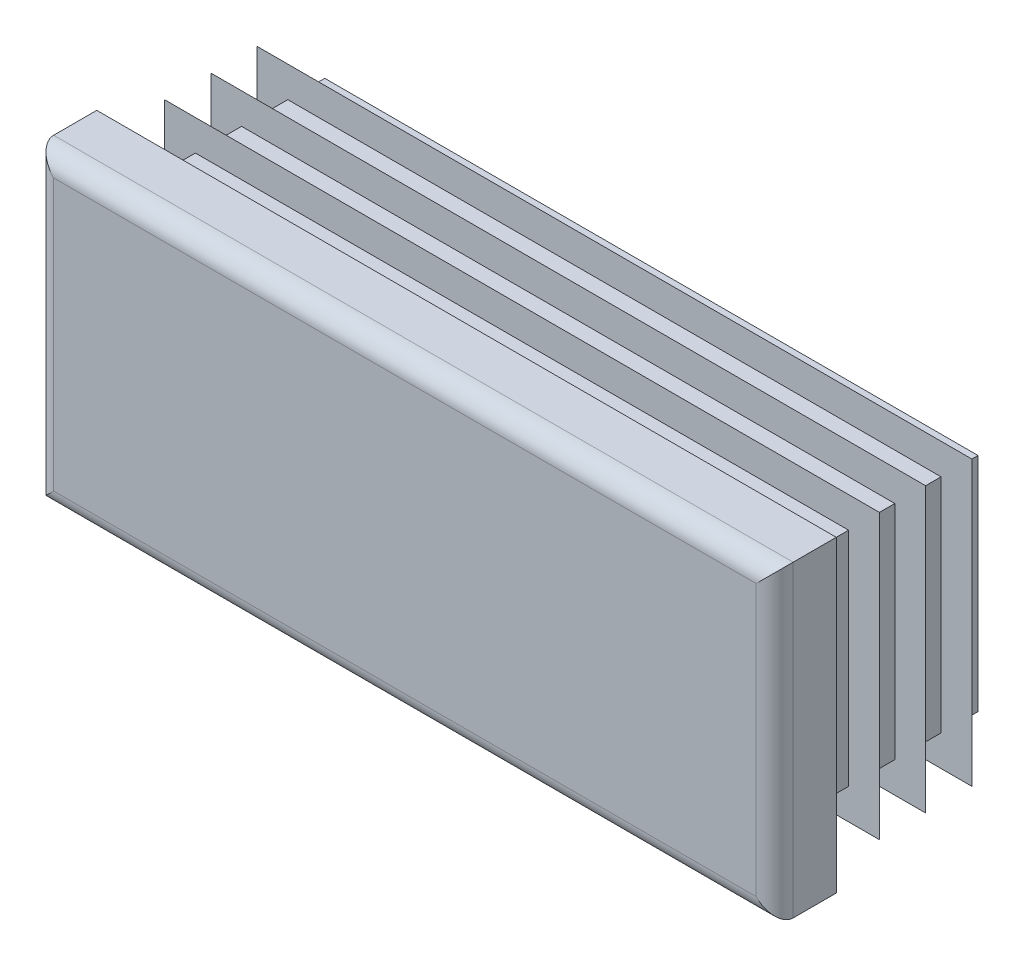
ISO-10303-21;
HEADER;
FILE_DESCRIPTION(('STEP AP214'),'2;1');
FILE_NAME('part.step','',(''),(''),'','','');
FILE_SCHEMA(('AUTOMOTIVE_DESIGN { 1 0 10303 214 1 1 1 1 }'));
ENDSEC;
DATA;
#1=APPLICATION_CONTEXT('core data for automotive mechanical design processes');
#2=APPLICATION_PROTOCOL_DEFINITION('international standard','automotive_design',2000,#1);
#3=PRODUCT_CONTEXT('',#1,'mechanical');
#4=PRODUCT('Part','Part','',(#3));
#5=PRODUCT_RELATED_PRODUCT_CATEGORY('part','',(#4));
#6=PRODUCT_DEFINITION_FORMATION('','',#4);
#7=PRODUCT_DEFINITION_CONTEXT('part definition',#1,'design');
#8=PRODUCT_DEFINITION('design','',#6,#7);
#9=PRODUCT_DEFINITION_SHAPE('','',#8);
#10=(LENGTH_UNIT() NAMED_UNIT(*) SI_UNIT(.MILLI.,.METRE.));
#11=(NAMED_UNIT(*) PLANE_ANGLE_UNIT() SI_UNIT($,.RADIAN.));
#12=(NAMED_UNIT(*) SI_UNIT($,.STERADIAN.) SOLID_ANGLE_UNIT());
#13=UNCERTAINTY_MEASURE_WITH_UNIT(LENGTH_MEASURE(1.E-05),#10,'distance_accuracy_value','');
#14=(GEOMETRIC_REPRESENTATION_CONTEXT(3) GLOBAL_UNCERTAINTY_ASSIGNED_CONTEXT((#13)) GLOBAL_UNIT_ASSIGNED_CONTEXT((#10,
#11,#12)) REPRESENTATION_CONTEXT('',''));
#15=CARTESIAN_POINT('',(0.,0.,0.));
#16=DIRECTION('',(0.,0.,1.));
#17=DIRECTION('',(1.,0.,0.));
#18=AXIS2_PLACEMENT_3D('',#15,#16,#17);
#19=CARTESIAN_POINT('',(28.5,-12.5,5.));
#20=DIRECTION('',(0.,0.,-1.));
#21=DIRECTION('',(0.,1.,0.));
#22=AXIS2_PLACEMENT_3D('',#19,#20,#21);
#23=PLANE('',#22);
#24=DIRECTION('',(0.,1.,0.));
#25=VECTOR('',#24,1.);
#26=CARTESIAN_POINT('',(-28.5,-12.5,5.));
#27=LINE('',#26,#25);
#28=CARTESIAN_POINT('',(-28.5,-11.,5.));
#29=VERTEX_POINT('',#28);
#30=CARTESIAN_POINT('',(-28.5,11.,5.));
#31=VERTEX_POINT('',#30);
#32=EDGE_CURVE('E310',#29,#31,#27,.T.);
#33=ORIENTED_EDGE('',*,*,#32,.F.);
#34=DIRECTION('',(-1.,0.,0.));
#35=VECTOR('',#34,1.);
#36=CARTESIAN_POINT('',(30.,-11.,5.));
#37=LINE('',#36,#35);
#38=CARTESIAN_POINT('',(28.5,-11.,5.));
#39=VERTEX_POINT('',#38);
#40=EDGE_CURVE('E482',#39,#29,#37,.T.);
#41=ORIENTED_EDGE('',*,*,#40,.F.);
#42=DIRECTION('',(0.,1.,0.));
#43=VECTOR('',#42,1.);
#44=CARTESIAN_POINT('',(28.5,-12.5,5.));
#45=LINE('',#44,#43);
#46=CARTESIAN_POINT('',(28.5,11.,5.));
#47=VERTEX_POINT('',#46);
#48=EDGE_CURVE('E305',#39,#47,#45,.T.);
#49=ORIENTED_EDGE('',*,*,#48,.T.);
#50=DIRECTION('',(-1.,0.,0.));
#51=VECTOR('',#50,1.);
#52=CARTESIAN_POINT('',(30.,11.,5.));
#53=LINE('',#52,#51);
#54=EDGE_CURVE('E630',#47,#31,#53,.T.);
#55=ORIENTED_EDGE('',*,*,#54,.T.);
#56=EDGE_LOOP('',(#33,#41,#49,#55));
#57=FACE_BOUND('',#56,.T.);
#58=ADVANCED_FACE('F14',(#57),#23,.F.);
#59=CARTESIAN_POINT('',(-28.5,-12.5,3.5));
#60=DIRECTION('',(0.,1.,0.));
#61=DIRECTION('',(-1.,0.,0.));
#62=AXIS2_PLACEMENT_3D('',#59,#60,#61);
#63=CYLINDRICAL_SURFACE('',#62,1.5);
#64=DIRECTION('',(0.,1.,0.));
#65=VECTOR('',#64,1.);
#66=CARTESIAN_POINT('',(-30.,-12.5,3.5));
#67=LINE('',#66,#65);
#68=CARTESIAN_POINT('',(-30.,-12.5,3.5));
#69=VERTEX_POINT('',#68);
#70=CARTESIAN_POINT('',(-30.,12.5,3.5));
#71=VERTEX_POINT('',#70);
#72=EDGE_CURVE('E402',#69,#71,#67,.T.);
#73=ORIENTED_EDGE('',*,*,#72,.F.);
#74=CARTESIAN_POINT('',(-28.5,-11.,3.5));
#75=DIRECTION('',(-0.707106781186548,0.707106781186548,0.));
#76=DIRECTION('',(0.707106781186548,0.707106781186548,0.));
#77=AXIS2_PLACEMENT_3D('',#74,#75,#76);
#78=ELLIPSE('',#77,2.12132034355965,1.5);
#79=EDGE_CURVE('E59',#69,#29,#78,.T.);
#80=ORIENTED_EDGE('',*,*,#79,.T.);
#81=ORIENTED_EDGE('',*,*,#32,.T.);
#82=CARTESIAN_POINT('',(-28.5,11.,3.5));
#83=DIRECTION('',(0.707106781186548,0.707106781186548,0.));
#84=DIRECTION('',(-0.707106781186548,0.707106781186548,0.));
#85=AXIS2_PLACEMENT_3D('',#82,#83,#84);
#86=ELLIPSE('',#85,2.12132034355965,1.5);
#87=EDGE_CURVE('E306',#31,#71,#86,.F.);
#88=ORIENTED_EDGE('',*,*,#87,.T.);
#89=EDGE_LOOP('',(#73,#80,#81,#88));
#90=FACE_BOUND('',#89,.T.);
#91=ADVANCED_FACE('F16',(#90),#63,.T.);
#92=CARTESIAN_POINT('',(-30.,-12.5,3.5));
#93=DIRECTION('',(1.,0.,0.));
#94=DIRECTION('',(0.,1.,0.));
#95=AXIS2_PLACEMENT_3D('',#92,#93,#94);
#96=PLANE('',#95);
#97=DIRECTION('',(0.,0.,-1.));
#98=VECTOR('',#97,1.);
#99=CARTESIAN_POINT('',(-30.,12.5,3.5));
#100=LINE('',#99,#98);
#101=CARTESIAN_POINT('',(-30.,12.5,0.));
#102=VERTEX_POINT('',#101);
#103=EDGE_CURVE('E615',#71,#102,#100,.T.);
#104=ORIENTED_EDGE('',*,*,#103,.T.);
#105=DIRECTION('',(0.,1.,0.));
#106=VECTOR('',#105,1.);
#107=CARTESIAN_POINT('',(-30.,-12.5,0.));
#108=LINE('',#107,#106);
#109=CARTESIAN_POINT('',(-30.,-12.5,0.));
#110=VERTEX_POINT('',#109);
#111=EDGE_CURVE('E400',#110,#102,#108,.T.);
#112=ORIENTED_EDGE('',*,*,#111,.F.);
#113=DIRECTION('',(0.,0.,-1.));
#114=VECTOR('',#113,1.);
#115=CARTESIAN_POINT('',(-30.,-12.5,3.5));
#116=LINE('',#115,#114);
#117=EDGE_CURVE('E616',#69,#110,#116,.T.);
#118=ORIENTED_EDGE('',*,*,#117,.F.);
#119=ORIENTED_EDGE('',*,*,#72,.T.);
#120=EDGE_LOOP('',(#104,#112,#118,#119));
#121=FACE_BOUND('',#120,.T.);
#122=ADVANCED_FACE('F697',(#121),#96,.F.);
#123=CARTESIAN_POINT('',(-26.5,-12.5,0.));
#124=DIRECTION('',(1.,0.,0.));
#125=DIRECTION('',(0.,1.,0.));
#126=AXIS2_PLACEMENT_3D('',#123,#124,#125);
#127=PLANE('',#126);
#128=DIRECTION('',(0.,1.,0.));
#129=VECTOR('',#128,1.);
#130=CARTESIAN_POINT('',(-26.5,-12.5,0.));
#131=LINE('',#130,#129);
#132=CARTESIAN_POINT('',(-26.5,-9.,0.));
#133=VERTEX_POINT('',#132);
#134=CARTESIAN_POINT('',(-26.5,9.,0.));
#135=VERTEX_POINT('',#134);
#136=EDGE_CURVE('E397',#133,#135,#131,.T.);
#137=ORIENTED_EDGE('',*,*,#136,.T.);
#138=DIRECTION('',(0.,0.,-1.));
#139=VECTOR('',#138,1.);
#140=CARTESIAN_POINT('',(-26.5,9.,0.));
#141=LINE('',#140,#139);
#142=CARTESIAN_POINT('',(-26.5,9.,-0.75));
#143=VERTEX_POINT('',#142);
#144=EDGE_CURVE('E495',#135,#143,#141,.T.);
#145=ORIENTED_EDGE('',*,*,#144,.T.);
#146=DIRECTION('',(0.,1.,0.));
#147=VECTOR('',#146,1.);
#148=CARTESIAN_POINT('',(-26.5,-12.5,-0.75));
#149=LINE('',#148,#147);
#150=CARTESIAN_POINT('',(-26.5,-9.,-0.75));
#151=VERTEX_POINT('',#150);
#152=EDGE_CURVE('E394',#151,#143,#149,.T.);
#153=ORIENTED_EDGE('',*,*,#152,.F.);
#154=DIRECTION('',(0.,0.,1.));
#155=VECTOR('',#154,1.);
#156=CARTESIAN_POINT('',(-26.5,-9.,0.));
#157=LINE('',#156,#155);
#158=EDGE_CURVE('E489',#151,#133,#157,.T.);
#159=ORIENTED_EDGE('',*,*,#158,.T.);
#160=EDGE_LOOP('',(#137,#145,#153,#159));
#161=FACE_BOUND('',#160,.T.);
#162=ADVANCED_FACE('F787',(#161),#127,.F.);
#163=CARTESIAN_POINT('',(-29.,-12.5,-0.75));
#164=DIRECTION('',(0.342020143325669,0.,0.939692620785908));
#165=DIRECTION('',(-0.939692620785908,0.,0.342020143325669));
#166=AXIS2_PLACEMENT_3D('',#163,#164,#165);
#167=PLANE('',#166);
#168=DIRECTION('',(0.,1.,0.));
#169=VECTOR('',#168,1.);
#170=CARTESIAN_POINT('',(-29.,-12.5,-0.75));
#171=LINE('',#170,#169);
#172=CARTESIAN_POINT('',(-29.,-11.5,-0.75));
#173=VERTEX_POINT('',#172);
#174=CARTESIAN_POINT('',(-29.,11.5,-0.75));
#175=VERTEX_POINT('',#174);
#176=EDGE_CURVE('E392',#173,#175,#171,.T.);
#177=ORIENTED_EDGE('',*,*,#176,.T.);
#178=DIRECTION('',(0.844349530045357,-0.438895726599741,-0.307318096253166));
#179=VECTOR('',#178,1.);
#180=CARTESIAN_POINT('',(-20.1060463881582,6.87689298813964,-3.98713437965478));
#181=LINE('',#180,#179);
#182=CARTESIAN_POINT('',(-26.5,10.2004915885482,-1.65992558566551));
#183=VERTEX_POINT('',#182);
#184=EDGE_CURVE('E519',#175,#183,#181,.T.);
#185=ORIENTED_EDGE('',*,*,#184,.T.);
#186=DIRECTION('',(0.,1.,0.));
#187=VECTOR('',#186,1.);
#188=CARTESIAN_POINT('',(-26.5,-12.5,-1.65992558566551));
#189=LINE('',#188,#187);
#190=CARTESIAN_POINT('',(-26.5,-10.2004915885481,-1.65992558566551));
#191=VERTEX_POINT('',#190);
#192=EDGE_CURVE('E389',#191,#183,#189,.T.);
#193=ORIENTED_EDGE('',*,*,#192,.F.);
#194=DIRECTION('',(-0.844349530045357,-0.438895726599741,0.307318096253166));
#195=VECTOR('',#194,1.);
#196=CARTESIAN_POINT('',(-29.3705814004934,-11.6926294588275,-0.615119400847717));
#197=LINE('',#196,#195);
#198=EDGE_CURVE('E507',#191,#173,#197,.T.);
#199=ORIENTED_EDGE('',*,*,#198,.T.);
#200=EDGE_LOOP('',(#177,#185,#193,#199));
#201=FACE_BOUND('',#200,.T.);
#202=ADVANCED_FACE('F783',(#201),#167,.F.);
#203=CARTESIAN_POINT('',(-26.5,-12.5,-1.65992558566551));
#204=DIRECTION('',(1.,0.,0.));
#205=DIRECTION('',(0.,1.,0.));
#206=AXIS2_PLACEMENT_3D('',#203,#204,#205);
#207=PLANE('',#206);
#208=ORIENTED_EDGE('',*,*,#192,.T.);
#209=DIRECTION('',(0.,-0.819152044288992,-0.573576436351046));
#210=VECTOR('',#209,1.);
#211=CARTESIAN_POINT('',(-26.5,-5.03176689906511,-12.3256678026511));
#212=LINE('',#211,#210);
#213=CARTESIAN_POINT('',(-26.5,9.,-2.50051884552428));
#214=VERTEX_POINT('',#213);
#215=EDGE_CURVE('E516',#183,#214,#212,.T.);
#216=ORIENTED_EDGE('',*,*,#215,.T.);
#217=DIRECTION('',(0.,0.,-1.));
#218=VECTOR('',#217,1.);
#219=CARTESIAN_POINT('',(-26.5,9.,-1.65992558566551));
#220=LINE('',#219,#218);
#221=CARTESIAN_POINT('',(-26.5,9.,-4.5));
#222=VERTEX_POINT('',#221);
#223=EDGE_CURVE('E525',#214,#222,#220,.T.);
#224=ORIENTED_EDGE('',*,*,#223,.T.);
#225=DIRECTION('',(0.,1.,0.));
#226=VECTOR('',#225,1.);
#227=CARTESIAN_POINT('',(-26.5,-12.5,-4.5));
#228=LINE('',#227,#226);
#229=CARTESIAN_POINT('',(-26.5,-9.,-4.5));
#230=VERTEX_POINT('',#229);
#231=EDGE_CURVE('E386',#230,#222,#228,.T.);
#232=ORIENTED_EDGE('',*,*,#231,.F.);
#233=DIRECTION('',(0.,0.,1.));
#234=VECTOR('',#233,1.);
#235=CARTESIAN_POINT('',(-26.5,-9.,-1.65992558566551));
#236=LINE('',#235,#234);
#237=CARTESIAN_POINT('',(-26.5,-9.,-2.50051884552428));
#238=VERTEX_POINT('',#237);
#239=EDGE_CURVE('E522',#230,#238,#236,.T.);
#240=ORIENTED_EDGE('',*,*,#239,.T.);
#241=DIRECTION('',(0.,-0.819152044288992,0.573576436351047));
#242=VECTOR('',#241,1.);
#243=CARTESIAN_POINT('',(-26.5,-11.7434848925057,-0.579510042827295));
#244=LINE('',#243,#242);
#245=EDGE_CURVE('E504',#238,#191,#244,.T.);
#246=ORIENTED_EDGE('',*,*,#245,.T.);
#247=EDGE_LOOP('',(#208,#216,#224,#232,#240,#246));
#248=FACE_BOUND('',#247,.T.);
#249=ADVANCED_FACE('F779',(#248),#207,.F.);
#250=CARTESIAN_POINT('',(-29.,-12.5,-4.5));
#251=DIRECTION('',(0.342020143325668,0.,0.939692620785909));
#252=DIRECTION('',(-0.939692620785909,0.,0.342020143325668));
#253=AXIS2_PLACEMENT_3D('',#250,#251,#252);
#254=PLANE('',#253);
#255=DIRECTION('',(0.,1.,0.));
#256=VECTOR('',#255,1.);
#257=CARTESIAN_POINT('',(-29.,-12.5,-4.5));
#258=LINE('',#257,#256);
#259=CARTESIAN_POINT('',(-29.,-11.5,-4.5));
#260=VERTEX_POINT('',#259);
#261=CARTESIAN_POINT('',(-29.,11.5,-4.5));
#262=VERTEX_POINT('',#261);
#263=EDGE_CURVE('E384',#260,#262,#258,.T.);
#264=ORIENTED_EDGE('',*,*,#263,.T.);
#265=DIRECTION('',(0.844349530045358,-0.43889572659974,-0.307318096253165));
#266=VECTOR('',#265,1.);
#267=CARTESIAN_POINT('',(-20.1060463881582,6.87689298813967,-7.73713437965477));
#268=LINE('',#267,#266);
#269=CARTESIAN_POINT('',(-26.5,10.2004915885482,-5.4099255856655));
#270=VERTEX_POINT('',#269);
#271=EDGE_CURVE('E549',#262,#270,#268,.T.);
#272=ORIENTED_EDGE('',*,*,#271,.T.);
#273=DIRECTION('',(0.,1.,0.));
#274=VECTOR('',#273,1.);
#275=CARTESIAN_POINT('',(-26.5,-12.5,-5.4099255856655));
#276=LINE('',#275,#274);
#277=CARTESIAN_POINT('',(-26.5,-10.2004915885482,-5.4099255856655));
#278=VERTEX_POINT('',#277);
#279=EDGE_CURVE('E381',#278,#270,#276,.T.);
#280=ORIENTED_EDGE('',*,*,#279,.F.);
#281=DIRECTION('',(-0.844349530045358,-0.438895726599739,0.307318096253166));
#282=VECTOR('',#281,1.);
#283=CARTESIAN_POINT('',(-29.3705814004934,-11.6926294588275,-4.36511940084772));
#284=LINE('',#283,#282);
#285=EDGE_CURVE('E537',#278,#260,#284,.T.);
#286=ORIENTED_EDGE('',*,*,#285,.T.);
#287=EDGE_LOOP('',(#264,#272,#280,#286));
#288=FACE_BOUND('',#287,.T.);
#289=ADVANCED_FACE('F775',(#288),#254,.F.);
#290=CARTESIAN_POINT('',(-26.5,-12.5,-5.4099255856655));
#291=DIRECTION('',(1.,0.,0.));
#292=DIRECTION('',(0.,1.,0.));
#293=AXIS2_PLACEMENT_3D('',#290,#291,#292);
#294=PLANE('',#293);
#295=ORIENTED_EDGE('',*,*,#279,.T.);
#296=DIRECTION('',(0.,-0.819152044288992,-0.573576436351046));
#297=VECTOR('',#296,1.);
#298=CARTESIAN_POINT('',(-26.5,-5.03176689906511,-16.0756678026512));
#299=LINE('',#298,#297);
#300=CARTESIAN_POINT('',(-26.5,9.,-6.25051884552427));
#301=VERTEX_POINT('',#300);
#302=EDGE_CURVE('E546',#270,#301,#299,.T.);
#303=ORIENTED_EDGE('',*,*,#302,.T.);
#304=DIRECTION('',(0.,0.,-1.));
#305=VECTOR('',#304,1.);
#306=CARTESIAN_POINT('',(-26.5,9.,-5.4099255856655));
#307=LINE('',#306,#305);
#308=CARTESIAN_POINT('',(-26.5,9.,-8.25));
#309=VERTEX_POINT('',#308);
#310=EDGE_CURVE('E555',#301,#309,#307,.T.);
#311=ORIENTED_EDGE('',*,*,#310,.T.);
#312=DIRECTION('',(0.,1.,0.));
#313=VECTOR('',#312,1.);
#314=CARTESIAN_POINT('',(-26.5,-12.5,-8.25));
#315=LINE('',#314,#313);
#316=CARTESIAN_POINT('',(-26.5,-9.,-8.25));
#317=VERTEX_POINT('',#316);
#318=EDGE_CURVE('E378',#317,#309,#315,.T.);
#319=ORIENTED_EDGE('',*,*,#318,.F.);
#320=DIRECTION('',(0.,0.,1.));
#321=VECTOR('',#320,1.);
#322=CARTESIAN_POINT('',(-26.5,-9.,-5.4099255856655));
#323=LINE('',#322,#321);
#324=CARTESIAN_POINT('',(-26.5,-9.,-6.25051884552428));
#325=VERTEX_POINT('',#324);
#326=EDGE_CURVE('E552',#317,#325,#323,.T.);
#327=ORIENTED_EDGE('',*,*,#326,.T.);
#328=DIRECTION('',(0.,-0.819152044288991,0.573576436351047));
#329=VECTOR('',#328,1.);
#330=CARTESIAN_POINT('',(-26.5,-11.7434848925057,-4.32951004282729));
#331=LINE('',#330,#329);
#332=EDGE_CURVE('E534',#325,#278,#331,.T.);
#333=ORIENTED_EDGE('',*,*,#332,.T.);
#334=EDGE_LOOP('',(#295,#303,#311,#319,#327,#333));
#335=FACE_BOUND('',#334,.T.);
#336=ADVANCED_FACE('F771',(#335),#294,.F.);
#337=CARTESIAN_POINT('',(-29.,-12.5,-8.25));
#338=DIRECTION('',(0.342020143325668,0.,0.939692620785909));
#339=DIRECTION('',(-0.939692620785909,0.,0.342020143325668));
#340=AXIS2_PLACEMENT_3D('',#337,#338,#339);
#341=PLANE('',#340);
#342=DIRECTION('',(0.,1.,0.));
#343=VECTOR('',#342,1.);
#344=CARTESIAN_POINT('',(-29.,-12.5,-8.25));
#345=LINE('',#344,#343);
#346=CARTESIAN_POINT('',(-29.,-11.5,-8.25));
#347=VERTEX_POINT('',#346);
#348=CARTESIAN_POINT('',(-29.,11.5,-8.25));
#349=VERTEX_POINT('',#348);
#350=EDGE_CURVE('E376',#347,#349,#345,.T.);
#351=ORIENTED_EDGE('',*,*,#350,.T.);
#352=DIRECTION('',(0.844349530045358,-0.43889572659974,-0.307318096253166));
#353=VECTOR('',#352,1.);
#354=CARTESIAN_POINT('',(-20.1060463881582,6.87689298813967,-11.4871343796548));
#355=LINE('',#354,#353);
#356=CARTESIAN_POINT('',(-26.5,10.2004915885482,-9.1599255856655));
#357=VERTEX_POINT('',#356);
#358=EDGE_CURVE('E579',#349,#357,#355,.T.);
#359=ORIENTED_EDGE('',*,*,#358,.T.);
#360=DIRECTION('',(0.,1.,0.));
#361=VECTOR('',#360,1.);
#362=CARTESIAN_POINT('',(-26.5,-12.5,-9.1599255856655));
#363=LINE('',#362,#361);
#364=CARTESIAN_POINT('',(-26.5,-10.2004915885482,-9.1599255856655));
#365=VERTEX_POINT('',#364);
#366=EDGE_CURVE('E373',#365,#357,#363,.T.);
#367=ORIENTED_EDGE('',*,*,#366,.F.);
#368=DIRECTION('',(-0.844349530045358,-0.438895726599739,0.307318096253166));
#369=VECTOR('',#368,1.);
#370=CARTESIAN_POINT('',(-29.3705814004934,-11.6926294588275,-8.11511940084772));
#371=LINE('',#370,#369);
#372=EDGE_CURVE('E567',#365,#347,#371,.T.);
#373=ORIENTED_EDGE('',*,*,#372,.T.);
#374=EDGE_LOOP('',(#351,#359,#367,#373));
#375=FACE_BOUND('',#374,.T.);
#376=ADVANCED_FACE('F767',(#375),#341,.F.);
#377=CARTESIAN_POINT('',(-26.5,-12.5,-9.1599255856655));
#378=DIRECTION('',(1.,0.,0.));
#379=DIRECTION('',(0.,1.,0.));
#380=AXIS2_PLACEMENT_3D('',#377,#378,#379);
#381=PLANE('',#380);
#382=ORIENTED_EDGE('',*,*,#366,.T.);
#383=DIRECTION('',(0.,-0.819152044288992,-0.573576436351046));
#384=VECTOR('',#383,1.);
#385=CARTESIAN_POINT('',(-26.5,-5.03176689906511,-19.8256678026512));
#386=LINE('',#385,#384);
#387=CARTESIAN_POINT('',(-26.5,9.,-10.0005188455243));
#388=VERTEX_POINT('',#387);
#389=EDGE_CURVE('E576',#357,#388,#386,.T.);
#390=ORIENTED_EDGE('',*,*,#389,.T.);
#391=DIRECTION('',(0.,0.,-1.));
#392=VECTOR('',#391,1.);
#393=CARTESIAN_POINT('',(-26.5,9.,-9.1599255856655));
#394=LINE('',#393,#392);
#395=CARTESIAN_POINT('',(-26.5,9.,-12.));
#396=VERTEX_POINT('',#395);
#397=EDGE_CURVE('E585',#388,#396,#394,.T.);
#398=ORIENTED_EDGE('',*,*,#397,.T.);
#399=DIRECTION('',(0.,1.,0.));
#400=VECTOR('',#399,1.);
#401=CARTESIAN_POINT('',(-26.5,-12.5,-12.));
#402=LINE('',#401,#400);
#403=CARTESIAN_POINT('',(-26.5,-9.,-12.));
#404=VERTEX_POINT('',#403);
#405=EDGE_CURVE('E370',#404,#396,#402,.T.);
#406=ORIENTED_EDGE('',*,*,#405,.F.);
#407=DIRECTION('',(0.,0.,1.));
#408=VECTOR('',#407,1.);
#409=CARTESIAN_POINT('',(-26.5,-9.,-9.1599255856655));
#410=LINE('',#409,#408);
#411=CARTESIAN_POINT('',(-26.5,-9.,-10.0005188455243));
#412=VERTEX_POINT('',#411);
#413=EDGE_CURVE('E582',#404,#412,#410,.T.);
#414=ORIENTED_EDGE('',*,*,#413,.T.);
#415=DIRECTION('',(0.,-0.819152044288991,0.573576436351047));
#416=VECTOR('',#415,1.);
#417=CARTESIAN_POINT('',(-26.5,-11.7434848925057,-8.07951004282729));
#418=LINE('',#417,#416);
#419=EDGE_CURVE('E564',#412,#365,#418,.T.);
#420=ORIENTED_EDGE('',*,*,#419,.T.);
#421=EDGE_LOOP('',(#382,#390,#398,#406,#414,#420));
#422=FACE_BOUND('',#421,.T.);
#423=ADVANCED_FACE('F764',(#422),#381,.F.);
#424=CARTESIAN_POINT('',(-29.,-12.5,-12.));
#425=DIRECTION('',(0.342020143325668,0.,0.939692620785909));
#426=DIRECTION('',(-0.939692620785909,0.,0.342020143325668));
#427=AXIS2_PLACEMENT_3D('',#424,#425,#426);
#428=PLANE('',#427);
#429=DIRECTION('',(0.,1.,0.));
#430=VECTOR('',#429,1.);
#431=CARTESIAN_POINT('',(-29.,-12.5,-12.));
#432=LINE('',#431,#430);
#433=CARTESIAN_POINT('',(-29.,-11.5,-12.));
#434=VERTEX_POINT('',#433);
#435=CARTESIAN_POINT('',(-29.,11.5,-12.));
#436=VERTEX_POINT('',#435);
#437=EDGE_CURVE('E368',#434,#436,#432,.T.);
#438=ORIENTED_EDGE('',*,*,#437,.T.);
#439=DIRECTION('',(0.844349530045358,-0.43889572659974,-0.307318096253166));
#440=VECTOR('',#439,1.);
#441=CARTESIAN_POINT('',(-20.1060463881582,6.87689298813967,-15.2371343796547));
#442=LINE('',#441,#440);
#443=CARTESIAN_POINT('',(-26.5,10.2004915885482,-12.9099255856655));
#444=VERTEX_POINT('',#443);
#445=EDGE_CURVE('E607',#436,#444,#442,.T.);
#446=ORIENTED_EDGE('',*,*,#445,.T.);
#447=DIRECTION('',(0.,1.,0.));
#448=VECTOR('',#447,1.);
#449=CARTESIAN_POINT('',(-26.5,-12.5,-12.9099255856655));
#450=LINE('',#449,#448);
#451=CARTESIAN_POINT('',(-26.5,-10.2004915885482,-12.9099255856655));
#452=VERTEX_POINT('',#451);
#453=EDGE_CURVE('E365',#452,#444,#450,.T.);
#454=ORIENTED_EDGE('',*,*,#453,.F.);
#455=DIRECTION('',(-0.844349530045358,-0.438895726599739,0.307318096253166));
#456=VECTOR('',#455,1.);
#457=CARTESIAN_POINT('',(-29.3705814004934,-11.6926294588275,-11.8651194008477));
#458=LINE('',#457,#456);
#459=EDGE_CURVE('E595',#452,#434,#458,.T.);
#460=ORIENTED_EDGE('',*,*,#459,.T.);
#461=EDGE_LOOP('',(#438,#446,#454,#460));
#462=FACE_BOUND('',#461,.T.);
#463=ADVANCED_FACE('F675',(#462),#428,.F.);
#464=CARTESIAN_POINT('',(-26.5,-12.5,-12.9099255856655));
#465=DIRECTION('',(1.,0.,0.));
#466=DIRECTION('',(0.,1.,0.));
#467=AXIS2_PLACEMENT_3D('',#464,#465,#466);
#468=PLANE('',#467);
#469=ORIENTED_EDGE('',*,*,#453,.T.);
#470=DIRECTION('',(0.,-0.819152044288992,-0.573576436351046));
#471=VECTOR('',#470,1.);
#472=CARTESIAN_POINT('',(-26.5,-5.03176689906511,-23.5756678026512));
#473=LINE('',#472,#471);
#474=CARTESIAN_POINT('',(-26.5,9.,-13.7505188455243));
#475=VERTEX_POINT('',#474);
#476=EDGE_CURVE('E604',#444,#475,#473,.T.);
#477=ORIENTED_EDGE('',*,*,#476,.T.);
#478=DIRECTION('',(0.,0.,-1.));
#479=VECTOR('',#478,1.);
#480=CARTESIAN_POINT('',(-26.5,9.,-12.9099255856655));
#481=LINE('',#480,#479);
#482=CARTESIAN_POINT('',(-26.5,9.,-15.));
#483=VERTEX_POINT('',#482);
#484=EDGE_CURVE('E613',#475,#483,#481,.T.);
#485=ORIENTED_EDGE('',*,*,#484,.T.);
#486=DIRECTION('',(0.,1.,0.));
#487=VECTOR('',#486,1.);
#488=CARTESIAN_POINT('',(-26.5,-12.5,-15.));
#489=LINE('',#488,#487);
#490=CARTESIAN_POINT('',(-26.5,-9.,-15.));
#491=VERTEX_POINT('',#490);
#492=EDGE_CURVE('E362',#491,#483,#489,.T.);
#493=ORIENTED_EDGE('',*,*,#492,.F.);
#494=DIRECTION('',(0.,0.,1.));
#495=VECTOR('',#494,1.);
#496=CARTESIAN_POINT('',(-26.5,-9.,-12.9099255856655));
#497=LINE('',#496,#495);
#498=CARTESIAN_POINT('',(-26.5,-9.,-13.7505188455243));
#499=VERTEX_POINT('',#498);
#500=EDGE_CURVE('E610',#491,#499,#497,.T.);
#501=ORIENTED_EDGE('',*,*,#500,.T.);
#502=DIRECTION('',(0.,-0.819152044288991,0.573576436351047));
#503=VECTOR('',#502,1.);
#504=CARTESIAN_POINT('',(-26.5,-11.7434848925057,-11.8295100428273));
#505=LINE('',#504,#503);
#506=EDGE_CURVE('E592',#499,#452,#505,.T.);
#507=ORIENTED_EDGE('',*,*,#506,.T.);
#508=EDGE_LOOP('',(#469,#477,#485,#493,#501,#507));
#509=FACE_BOUND('',#508,.T.);
#510=ADVANCED_FACE('F677',(#509),#468,.F.);
#511=CARTESIAN_POINT('',(-26.5,-12.5,-15.));
#512=DIRECTION('',(0.,0.,1.));
#513=DIRECTION('',(0.,-1.,0.));
#514=AXIS2_PLACEMENT_3D('',#511,#512,#513);
#515=PLANE('',#514);
#516=ORIENTED_EDGE('',*,*,#492,.T.);
#517=DIRECTION('',(-1.,0.,0.));
#518=VECTOR('',#517,1.);
#519=CARTESIAN_POINT('',(30.,9.,-15.));
#520=LINE('',#519,#518);
#521=CARTESIAN_POINT('',(26.5,9.,-15.));
#522=VERTEX_POINT('',#521);
#523=EDGE_CURVE('E438',#522,#483,#520,.T.);
#524=ORIENTED_EDGE('',*,*,#523,.F.);
#525=DIRECTION('',(0.,1.,0.));
#526=VECTOR('',#525,1.);
#527=CARTESIAN_POINT('',(26.5,-12.5,-15.));
#528=LINE('',#527,#526);
#529=CARTESIAN_POINT('',(26.5,-9.,-15.));
#530=VERTEX_POINT('',#529);
#531=EDGE_CURVE('E359',#530,#522,#528,.T.);
#532=ORIENTED_EDGE('',*,*,#531,.F.);
#533=DIRECTION('',(-1.,0.,0.));
#534=VECTOR('',#533,1.);
#535=CARTESIAN_POINT('',(30.,-9.,-15.));
#536=LINE('',#535,#534);
#537=EDGE_CURVE('E436',#530,#491,#536,.T.);
#538=ORIENTED_EDGE('',*,*,#537,.T.);
#539=EDGE_LOOP('',(#516,#524,#532,#538));
#540=FACE_BOUND('',#539,.T.);
#541=ADVANCED_FACE('F435',(#540),#515,.F.);
#542=CARTESIAN_POINT('',(26.5,-12.5,-15.));
#543=DIRECTION('',(-1.,0.,0.));
#544=DIRECTION('',(0.,-1.,0.));
#545=AXIS2_PLACEMENT_3D('',#542,#543,#544);
#546=PLANE('',#545);
#547=DIRECTION('',(0.,0.,1.));
#548=VECTOR('',#547,1.);
#549=CARTESIAN_POINT('',(26.5,9.,-15.));
#550=LINE('',#549,#548);
#551=CARTESIAN_POINT('',(26.5,9.,-13.7505188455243));
#552=VERTEX_POINT('',#551);
#553=EDGE_CURVE('E9',#522,#552,#550,.T.);
#554=ORIENTED_EDGE('',*,*,#553,.T.);
#555=DIRECTION('',(0.,0.819152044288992,0.573576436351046));
#556=VECTOR('',#555,1.);
#557=CARTESIAN_POINT('',(26.5,-6.01378065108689,-24.2632812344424));
#558=LINE('',#557,#556);
#559=CARTESIAN_POINT('',(26.5,10.2004915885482,-12.9099255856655));
#560=VERTEX_POINT('',#559);
#561=EDGE_CURVE('E601',#552,#560,#558,.T.);
#562=ORIENTED_EDGE('',*,*,#561,.T.);
#563=DIRECTION('',(0.,1.,0.));
#564=VECTOR('',#563,1.);
#565=CARTESIAN_POINT('',(26.5,-12.5,-12.9099255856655));
#566=LINE('',#565,#564);
#567=CARTESIAN_POINT('',(26.5,-10.2004915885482,-12.9099255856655));
#568=VERTEX_POINT('',#567);
#569=EDGE_CURVE('E356',#568,#560,#566,.T.);
#570=ORIENTED_EDGE('',*,*,#569,.F.);
#571=DIRECTION('',(0.,0.819152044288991,-0.573576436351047));
#572=VECTOR('',#571,1.);
#573=CARTESIAN_POINT('',(26.5,-10.761471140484,-12.5171234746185));
#574=LINE('',#573,#572);
#575=CARTESIAN_POINT('',(26.5,-9.,-13.7505188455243));
#576=VERTEX_POINT('',#575);
#577=EDGE_CURVE('E428',#568,#576,#574,.T.);
#578=ORIENTED_EDGE('',*,*,#577,.T.);
#579=DIRECTION('',(0.,0.,-1.));
#580=VECTOR('',#579,1.);
#581=CARTESIAN_POINT('',(26.5,-9.,-15.));
#582=LINE('',#581,#580);
#583=EDGE_CURVE('E23',#576,#530,#582,.T.);
#584=ORIENTED_EDGE('',*,*,#583,.T.);
#585=ORIENTED_EDGE('',*,*,#531,.T.);
#586=EDGE_LOOP('',(#554,#562,#570,#578,#584,#585));
#587=FACE_BOUND('',#586,.T.);
#588=ADVANCED_FACE('F426',(#587),#546,.F.);
#589=CARTESIAN_POINT('',(26.5,-12.5,-12.9099255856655));
#590=DIRECTION('',(-0.342020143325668,0.,0.939692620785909));
#591=DIRECTION('',(-0.939692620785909,0.,-0.342020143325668));
#592=AXIS2_PLACEMENT_3D('',#589,#590,#591);
#593=PLANE('',#592);
#594=ORIENTED_EDGE('',*,*,#569,.T.);
#595=DIRECTION('',(0.844349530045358,0.43889572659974,0.307318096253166));
#596=VECTOR('',#595,1.);
#597=CARTESIAN_POINT('',(18.0876200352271,5.8277081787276,-15.9717814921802));
#598=LINE('',#597,#596);
#599=CARTESIAN_POINT('',(29.,11.5,-12.));
#600=VERTEX_POINT('',#599);
#601=EDGE_CURVE('E598',#560,#600,#598,.T.);
#602=ORIENTED_EDGE('',*,*,#601,.T.);
#603=DIRECTION('',(0.,1.,0.));
#604=VECTOR('',#603,1.);
#605=CARTESIAN_POINT('',(29.,-12.5,-12.));
#606=LINE('',#605,#604);
#607=CARTESIAN_POINT('',(29.,-11.5,-12.));
#608=VERTEX_POINT('',#607);
#609=EDGE_CURVE('E353',#608,#600,#606,.T.);
#610=ORIENTED_EDGE('',*,*,#609,.F.);
#611=DIRECTION('',(-0.844349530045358,0.438895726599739,-0.307318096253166));
#612=VECTOR('',#611,1.);
#613=CARTESIAN_POINT('',(27.3521550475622,-10.6434446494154,-12.5997665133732));
#614=LINE('',#613,#612);
#615=EDGE_CURVE('E588',#608,#568,#614,.T.);
#616=ORIENTED_EDGE('',*,*,#615,.T.);
#617=EDGE_LOOP('',(#594,#602,#610,#616));
#618=FACE_BOUND('',#617,.T.);
#619=ADVANCED_FACE('F752',(#618),#593,.F.);
#620=CARTESIAN_POINT('',(29.,-12.5,-12.));
#621=DIRECTION('',(0.,0.,-1.));
#622=DIRECTION('',(0.,1.,0.));
#623=AXIS2_PLACEMENT_3D('',#620,#621,#622);
#624=PLANE('',#623);
#625=ORIENTED_EDGE('',*,*,#609,.T.);
#626=DIRECTION('',(-1.,0.,0.));
#627=VECTOR('',#626,1.);
#628=CARTESIAN_POINT('',(30.,11.5,-12.));
#629=LINE('',#628,#627);
#630=EDGE_CURVE('E444',#600,#436,#629,.T.);
#631=ORIENTED_EDGE('',*,*,#630,.T.);
#632=ORIENTED_EDGE('',*,*,#437,.F.);
#633=DIRECTION('',(-1.,0.,0.));
#634=VECTOR('',#633,1.);
#635=CARTESIAN_POINT('',(30.,-11.5,-12.));
#636=LINE('',#635,#634);
#637=EDGE_CURVE('E451',#608,#434,#636,.T.);
#638=ORIENTED_EDGE('',*,*,#637,.F.);
#639=EDGE_LOOP('',(#625,#631,#632,#638));
#640=FACE_BOUND('',#639,.T.);
#641=ORIENTED_EDGE('',*,*,#405,.T.);
#642=DIRECTION('',(-1.,0.,0.));
#643=VECTOR('',#642,1.);
#644=CARTESIAN_POINT('',(30.,9.,-12.));
#645=LINE('',#644,#643);
#646=CARTESIAN_POINT('',(26.5,9.,-12.));
#647=VERTEX_POINT('',#646);
#648=EDGE_CURVE('E663',#647,#396,#645,.T.);
#649=ORIENTED_EDGE('',*,*,#648,.F.);
#650=DIRECTION('',(0.,1.,0.));
#651=VECTOR('',#650,1.);
#652=CARTESIAN_POINT('',(26.5,-12.5,-12.));
#653=LINE('',#652,#651);
#654=CARTESIAN_POINT('',(26.5,-9.,-12.));
#655=VERTEX_POINT('',#654);
#656=EDGE_CURVE('E350',#655,#647,#653,.T.);
#657=ORIENTED_EDGE('',*,*,#656,.F.);
#658=DIRECTION('',(-1.,0.,0.));
#659=VECTOR('',#658,1.);
#660=CARTESIAN_POINT('',(30.,-9.,-12.));
#661=LINE('',#660,#659);
#662=EDGE_CURVE('E453',#655,#404,#661,.T.);
#663=ORIENTED_EDGE('',*,*,#662,.T.);
#664=EDGE_LOOP('',(#641,#649,#657,#663));
#665=FACE_BOUND('',#664,.T.);
#666=ADVANCED_FACE('F667',(#640,#665),#624,.F.);
#667=CARTESIAN_POINT('',(26.5,-12.5,-12.));
#668=DIRECTION('',(-1.,0.,0.));
#669=DIRECTION('',(0.,-1.,0.));
#670=AXIS2_PLACEMENT_3D('',#667,#668,#669);
#671=PLANE('',#670);
#672=DIRECTION('',(0.,0.,1.));
#673=VECTOR('',#672,1.);
#674=CARTESIAN_POINT('',(26.5,9.,-12.));
#675=LINE('',#674,#673);
#676=CARTESIAN_POINT('',(26.5,9.,-10.0005188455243));
#677=VERTEX_POINT('',#676);
#678=EDGE_CURVE('E420',#647,#677,#675,.T.);
#679=ORIENTED_EDGE('',*,*,#678,.T.);
#680=DIRECTION('',(0.,0.819152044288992,0.573576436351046));
#681=VECTOR('',#680,1.);
#682=CARTESIAN_POINT('',(26.5,-6.3661653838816,-20.7600236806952));
#683=LINE('',#682,#681);
#684=CARTESIAN_POINT('',(26.5,10.2004915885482,-9.1599255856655));
#685=VERTEX_POINT('',#684);
#686=EDGE_CURVE('E573',#677,#685,#683,.T.);
#687=ORIENTED_EDGE('',*,*,#686,.T.);
#688=DIRECTION('',(0.,1.,0.));
#689=VECTOR('',#688,1.);
#690=CARTESIAN_POINT('',(26.5,-12.5,-9.1599255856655));
#691=LINE('',#690,#689);
#692=CARTESIAN_POINT('',(26.5,-10.2004915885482,-9.15992558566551));
#693=VERTEX_POINT('',#692);
#694=EDGE_CURVE('E347',#693,#685,#691,.T.);
#695=ORIENTED_EDGE('',*,*,#694,.F.);
#696=DIRECTION('',(0.,0.819152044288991,-0.573576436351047));
#697=VECTOR('',#696,1.);
#698=CARTESIAN_POINT('',(26.5,-10.4090864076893,-9.01386592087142));
#699=LINE('',#698,#697);
#700=CARTESIAN_POINT('',(26.5,-9.,-10.0005188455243));
#701=VERTEX_POINT('',#700);
#702=EDGE_CURVE('E561',#693,#701,#699,.T.);
#703=ORIENTED_EDGE('',*,*,#702,.T.);
#704=DIRECTION('',(0.,0.,-1.));
#705=VECTOR('',#704,1.);
#706=CARTESIAN_POINT('',(26.5,-9.,-12.));
#707=LINE('',#706,#705);
#708=EDGE_CURVE('E417',#701,#655,#707,.T.);
#709=ORIENTED_EDGE('',*,*,#708,.T.);
#710=ORIENTED_EDGE('',*,*,#656,.T.);
#711=EDGE_LOOP('',(#679,#687,#695,#703,#709,#710));
#712=FACE_BOUND('',#711,.T.);
#713=ADVANCED_FACE('F745',(#712),#671,.F.);
#714=CARTESIAN_POINT('',(26.5,-12.5,-9.1599255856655));
#715=DIRECTION('',(-0.342020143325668,0.,0.939692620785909));
#716=DIRECTION('',(-0.939692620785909,0.,-0.342020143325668));
#717=AXIS2_PLACEMENT_3D('',#714,#715,#716);
#718=PLANE('',#717);
#719=ORIENTED_EDGE('',*,*,#694,.T.);
#720=DIRECTION('',(0.844349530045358,0.43889572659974,0.307318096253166));
#721=VECTOR('',#720,1.);
#722=CARTESIAN_POINT('',(18.0876200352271,5.8277081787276,-12.2217814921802));
#723=LINE('',#722,#721);
#724=CARTESIAN_POINT('',(29.,11.5,-8.25));
#725=VERTEX_POINT('',#724);
#726=EDGE_CURVE('E570',#685,#725,#723,.T.);
#727=ORIENTED_EDGE('',*,*,#726,.T.);
#728=DIRECTION('',(0.,1.,0.));
#729=VECTOR('',#728,1.);
#730=CARTESIAN_POINT('',(29.,-12.5,-8.25));
#731=LINE('',#730,#729);
#732=CARTESIAN_POINT('',(29.,-11.5,-8.25));
#733=VERTEX_POINT('',#732);
#734=EDGE_CURVE('E344',#733,#725,#731,.T.);
#735=ORIENTED_EDGE('',*,*,#734,.F.);
#736=DIRECTION('',(-0.844349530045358,0.438895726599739,-0.307318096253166));
#737=VECTOR('',#736,1.);
#738=CARTESIAN_POINT('',(27.3521550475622,-10.6434446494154,-8.84976651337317));
#739=LINE('',#738,#737);
#740=EDGE_CURVE('E558',#733,#693,#739,.T.);
#741=ORIENTED_EDGE('',*,*,#740,.T.);
#742=EDGE_LOOP('',(#719,#727,#735,#741));
#743=FACE_BOUND('',#742,.T.);
#744=ADVANCED_FACE('F741',(#743),#718,.F.);
#745=CARTESIAN_POINT('',(29.,-12.5,-8.25));
#746=DIRECTION('',(0.,0.,-1.));
#747=DIRECTION('',(0.,1.,0.));
#748=AXIS2_PLACEMENT_3D('',#745,#746,#747);
#749=PLANE('',#748);
#750=ORIENTED_EDGE('',*,*,#734,.T.);
#751=DIRECTION('',(-1.,0.,0.));
#752=VECTOR('',#751,1.);
#753=CARTESIAN_POINT('',(30.,11.5,-8.25));
#754=LINE('',#753,#752);
#755=EDGE_CURVE('E657',#725,#349,#754,.T.);
#756=ORIENTED_EDGE('',*,*,#755,.T.);
#757=ORIENTED_EDGE('',*,*,#350,.F.);
#758=DIRECTION('',(-1.,0.,0.));
#759=VECTOR('',#758,1.);
#760=CARTESIAN_POINT('',(30.,-11.5,-8.25));
#761=LINE('',#760,#759);
#762=EDGE_CURVE('E459',#733,#347,#761,.T.);
#763=ORIENTED_EDGE('',*,*,#762,.F.);
#764=EDGE_LOOP('',(#750,#756,#757,#763));
#765=FACE_BOUND('',#764,.T.);
#766=ORIENTED_EDGE('',*,*,#318,.T.);
#767=DIRECTION('',(-1.,0.,0.));
#768=VECTOR('',#767,1.);
#769=CARTESIAN_POINT('',(30.,9.,-8.25));
#770=LINE('',#769,#768);
#771=CARTESIAN_POINT('',(26.5,9.,-8.25));
#772=VERTEX_POINT('',#771);
#773=EDGE_CURVE('E655',#772,#309,#770,.T.);
#774=ORIENTED_EDGE('',*,*,#773,.F.);
#775=DIRECTION('',(0.,1.,0.));
#776=VECTOR('',#775,1.);
#777=CARTESIAN_POINT('',(26.5,-12.5,-8.25));
#778=LINE('',#777,#776);
#779=CARTESIAN_POINT('',(26.5,-9.,-8.25));
#780=VERTEX_POINT('',#779);
#781=EDGE_CURVE('E341',#780,#772,#778,.T.);
#782=ORIENTED_EDGE('',*,*,#781,.F.);
#783=DIRECTION('',(-1.,0.,0.));
#784=VECTOR('',#783,1.);
#785=CARTESIAN_POINT('',(30.,-9.,-8.25));
#786=LINE('',#785,#784);
#787=EDGE_CURVE('E461',#780,#317,#786,.T.);
#788=ORIENTED_EDGE('',*,*,#787,.T.);
#789=EDGE_LOOP('',(#766,#774,#782,#788));
#790=FACE_BOUND('',#789,.T.);
#791=ADVANCED_FACE('F737',(#765,#790),#749,.F.);
#792=CARTESIAN_POINT('',(26.5,-12.5,-8.25));
#793=DIRECTION('',(-1.,0.,0.));
#794=DIRECTION('',(0.,-1.,0.));
#795=AXIS2_PLACEMENT_3D('',#792,#793,#794);
#796=PLANE('',#795);
#797=DIRECTION('',(0.,0.,1.));
#798=VECTOR('',#797,1.);
#799=CARTESIAN_POINT('',(26.5,9.,-8.25));
#800=LINE('',#799,#798);
#801=CARTESIAN_POINT('',(26.5,9.,-6.25051884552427));
#802=VERTEX_POINT('',#801);
#803=EDGE_CURVE('E414',#772,#802,#800,.T.);
#804=ORIENTED_EDGE('',*,*,#803,.T.);
#805=DIRECTION('',(0.,0.819152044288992,0.573576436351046));
#806=VECTOR('',#805,1.);
#807=CARTESIAN_POINT('',(26.5,-6.3661653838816,-17.0100236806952));
#808=LINE('',#807,#806);
#809=CARTESIAN_POINT('',(26.5,10.2004915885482,-5.40992558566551));
#810=VERTEX_POINT('',#809);
#811=EDGE_CURVE('E543',#802,#810,#808,.T.);
#812=ORIENTED_EDGE('',*,*,#811,.T.);
#813=DIRECTION('',(0.,1.,0.));
#814=VECTOR('',#813,1.);
#815=CARTESIAN_POINT('',(26.5,-12.5,-5.40992558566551));
#816=LINE('',#815,#814);
#817=CARTESIAN_POINT('',(26.5,-10.2004915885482,-5.40992558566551));
#818=VERTEX_POINT('',#817);
#819=EDGE_CURVE('E338',#818,#810,#816,.T.);
#820=ORIENTED_EDGE('',*,*,#819,.F.);
#821=DIRECTION('',(0.,0.819152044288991,-0.573576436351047));
#822=VECTOR('',#821,1.);
#823=CARTESIAN_POINT('',(26.5,-10.4090864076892,-5.26386592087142));
#824=LINE('',#823,#822);
#825=CARTESIAN_POINT('',(26.5,-9.,-6.25051884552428));
#826=VERTEX_POINT('',#825);
#827=EDGE_CURVE('E531',#818,#826,#824,.T.);
#828=ORIENTED_EDGE('',*,*,#827,.T.);
#829=DIRECTION('',(0.,0.,-1.));
#830=VECTOR('',#829,1.);
#831=CARTESIAN_POINT('',(26.5,-9.,-8.25));
#832=LINE('',#831,#830);
#833=EDGE_CURVE('E411',#826,#780,#832,.T.);
#834=ORIENTED_EDGE('',*,*,#833,.T.);
#835=ORIENTED_EDGE('',*,*,#781,.T.);
#836=EDGE_LOOP('',(#804,#812,#820,#828,#834,#835));
#837=FACE_BOUND('',#836,.T.);
#838=ADVANCED_FACE('F733',(#837),#796,.F.);
#839=CARTESIAN_POINT('',(26.5,-12.5,-5.40992558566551));
#840=DIRECTION('',(-0.342020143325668,0.,0.939692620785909));
#841=DIRECTION('',(-0.939692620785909,0.,-0.342020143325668));
#842=AXIS2_PLACEMENT_3D('',#839,#840,#841);
#843=PLANE('',#842);
#844=ORIENTED_EDGE('',*,*,#819,.T.);
#845=DIRECTION('',(0.844349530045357,0.43889572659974,0.307318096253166));
#846=VECTOR('',#845,1.);
#847=CARTESIAN_POINT('',(18.0876200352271,5.82770817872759,-8.47178149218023));
#848=LINE('',#847,#846);
#849=CARTESIAN_POINT('',(29.,11.5,-4.5));
#850=VERTEX_POINT('',#849);
#851=EDGE_CURVE('E540',#810,#850,#848,.T.);
#852=ORIENTED_EDGE('',*,*,#851,.T.);
#853=DIRECTION('',(0.,1.,0.));
#854=VECTOR('',#853,1.);
#855=CARTESIAN_POINT('',(29.,-12.5,-4.5));
#856=LINE('',#855,#854);
#857=CARTESIAN_POINT('',(29.,-11.5,-4.5));
#858=VERTEX_POINT('',#857);
#859=EDGE_CURVE('E335',#858,#850,#856,.T.);
#860=ORIENTED_EDGE('',*,*,#859,.F.);
#861=DIRECTION('',(-0.844349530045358,0.438895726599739,-0.307318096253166));
#862=VECTOR('',#861,1.);
#863=CARTESIAN_POINT('',(27.3521550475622,-10.6434446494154,-5.09976651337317));
#864=LINE('',#863,#862);
#865=EDGE_CURVE('E528',#858,#818,#864,.T.);
#866=ORIENTED_EDGE('',*,*,#865,.T.);
#867=EDGE_LOOP('',(#844,#852,#860,#866));
#868=FACE_BOUND('',#867,.T.);
#869=ADVANCED_FACE('F729',(#868),#843,.F.);
#870=CARTESIAN_POINT('',(29.,-12.5,-4.5));
#871=DIRECTION('',(0.,0.,-1.));
#872=DIRECTION('',(0.,1.,0.));
#873=AXIS2_PLACEMENT_3D('',#870,#871,#872);
#874=PLANE('',#873);
#875=ORIENTED_EDGE('',*,*,#859,.T.);
#876=DIRECTION('',(-1.,0.,0.));
#877=VECTOR('',#876,1.);
#878=CARTESIAN_POINT('',(30.,11.5,-4.5));
#879=LINE('',#878,#877);
#880=EDGE_CURVE('E649',#850,#262,#879,.T.);
#881=ORIENTED_EDGE('',*,*,#880,.T.);
#882=ORIENTED_EDGE('',*,*,#263,.F.);
#883=DIRECTION('',(-1.,0.,0.));
#884=VECTOR('',#883,1.);
#885=CARTESIAN_POINT('',(30.,-11.5,-4.5));
#886=LINE('',#885,#884);
#887=EDGE_CURVE('E467',#858,#260,#886,.T.);
#888=ORIENTED_EDGE('',*,*,#887,.F.);
#889=EDGE_LOOP('',(#875,#881,#882,#888));
#890=FACE_BOUND('',#889,.T.);
#891=ORIENTED_EDGE('',*,*,#231,.T.);
#892=DIRECTION('',(-1.,0.,0.));
#893=VECTOR('',#892,1.);
#894=CARTESIAN_POINT('',(30.,9.,-4.5));
#895=LINE('',#894,#893);
#896=CARTESIAN_POINT('',(26.5,9.,-4.5));
#897=VERTEX_POINT('',#896);
#898=EDGE_CURVE('E647',#897,#222,#895,.T.);
#899=ORIENTED_EDGE('',*,*,#898,.F.);
#900=DIRECTION('',(0.,1.,0.));
#901=VECTOR('',#900,1.);
#902=CARTESIAN_POINT('',(26.5,-12.5,-4.5));
#903=LINE('',#902,#901);
#904=CARTESIAN_POINT('',(26.5,-9.,-4.5));
#905=VERTEX_POINT('',#904);
#906=EDGE_CURVE('E332',#905,#897,#903,.T.);
#907=ORIENTED_EDGE('',*,*,#906,.F.);
#908=DIRECTION('',(-1.,0.,0.));
#909=VECTOR('',#908,1.);
#910=CARTESIAN_POINT('',(30.,-9.,-4.5));
#911=LINE('',#910,#909);
#912=EDGE_CURVE('E469',#905,#230,#911,.T.);
#913=ORIENTED_EDGE('',*,*,#912,.T.);
#914=EDGE_LOOP('',(#891,#899,#907,#913));
#915=FACE_BOUND('',#914,.T.);
#916=ADVANCED_FACE('F725',(#890,#915),#874,.F.);
#917=CARTESIAN_POINT('',(26.5,-12.5,-4.5));
#918=DIRECTION('',(-1.,0.,0.));
#919=DIRECTION('',(0.,-1.,0.));
#920=AXIS2_PLACEMENT_3D('',#917,#918,#919);
#921=PLANE('',#920);
#922=DIRECTION('',(0.,0.,1.));
#923=VECTOR('',#922,1.);
#924=CARTESIAN_POINT('',(26.5,9.,-4.5));
#925=LINE('',#924,#923);
#926=CARTESIAN_POINT('',(26.5,9.,-2.50051884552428));
#927=VERTEX_POINT('',#926);
#928=EDGE_CURVE('E408',#897,#927,#925,.T.);
#929=ORIENTED_EDGE('',*,*,#928,.T.);
#930=DIRECTION('',(0.,0.819152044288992,0.573576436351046));
#931=VECTOR('',#930,1.);
#932=CARTESIAN_POINT('',(26.5,-6.3661653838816,-13.2600236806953));
#933=LINE('',#932,#931);
#934=CARTESIAN_POINT('',(26.5,10.2004915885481,-1.65992558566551));
#935=VERTEX_POINT('',#934);
#936=EDGE_CURVE('E513',#927,#935,#933,.T.);
#937=ORIENTED_EDGE('',*,*,#936,.T.);
#938=DIRECTION('',(0.,1.,0.));
#939=VECTOR('',#938,1.);
#940=CARTESIAN_POINT('',(26.5,-12.5,-1.65992558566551));
#941=LINE('',#940,#939);
#942=CARTESIAN_POINT('',(26.5,-10.2004915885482,-1.65992558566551));
#943=VERTEX_POINT('',#942);
#944=EDGE_CURVE('E329',#943,#935,#941,.T.);
#945=ORIENTED_EDGE('',*,*,#944,.F.);
#946=DIRECTION('',(0.,0.819152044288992,-0.573576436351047));
#947=VECTOR('',#946,1.);
#948=CARTESIAN_POINT('',(26.5,-10.4090864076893,-1.51386592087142));
#949=LINE('',#948,#947);
#950=CARTESIAN_POINT('',(26.5,-9.,-2.50051884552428));
#951=VERTEX_POINT('',#950);
#952=EDGE_CURVE('E501',#943,#951,#949,.T.);
#953=ORIENTED_EDGE('',*,*,#952,.T.);
#954=DIRECTION('',(0.,0.,-1.));
#955=VECTOR('',#954,1.);
#956=CARTESIAN_POINT('',(26.5,-9.,-4.5));
#957=LINE('',#956,#955);
#958=EDGE_CURVE('E405',#951,#905,#957,.T.);
#959=ORIENTED_EDGE('',*,*,#958,.T.);
#960=ORIENTED_EDGE('',*,*,#906,.T.);
#961=EDGE_LOOP('',(#929,#937,#945,#953,#959,#960));
#962=FACE_BOUND('',#961,.T.);
#963=ADVANCED_FACE('F721',(#962),#921,.F.);
#964=CARTESIAN_POINT('',(26.5,-12.5,-1.65992558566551));
#965=DIRECTION('',(-0.342020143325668,0.,0.939692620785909));
#966=DIRECTION('',(-0.939692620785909,0.,-0.342020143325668));
#967=AXIS2_PLACEMENT_3D('',#964,#965,#966);
#968=PLANE('',#967);
#969=ORIENTED_EDGE('',*,*,#944,.T.);
#970=DIRECTION('',(0.844349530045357,0.43889572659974,0.307318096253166));
#971=VECTOR('',#970,1.);
#972=CARTESIAN_POINT('',(18.0876200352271,5.82770817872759,-4.72178149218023));
#973=LINE('',#972,#971);
#974=CARTESIAN_POINT('',(29.,11.5,-0.75));
#975=VERTEX_POINT('',#974);
#976=EDGE_CURVE('E510',#935,#975,#973,.T.);
#977=ORIENTED_EDGE('',*,*,#976,.T.);
#978=DIRECTION('',(0.,1.,0.));
#979=VECTOR('',#978,1.);
#980=CARTESIAN_POINT('',(29.,-12.5,-0.75));
#981=LINE('',#980,#979);
#982=CARTESIAN_POINT('',(29.,-11.5,-0.75));
#983=VERTEX_POINT('',#982);
#984=EDGE_CURVE('E326',#983,#975,#981,.T.);
#985=ORIENTED_EDGE('',*,*,#984,.F.);
#986=DIRECTION('',(-0.844349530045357,0.43889572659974,-0.307318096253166));
#987=VECTOR('',#986,1.);
#988=CARTESIAN_POINT('',(27.3521550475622,-10.6434446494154,-1.34976651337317));
#989=LINE('',#988,#987);
#990=EDGE_CURVE('E498',#983,#943,#989,.T.);
#991=ORIENTED_EDGE('',*,*,#990,.T.);
#992=EDGE_LOOP('',(#969,#977,#985,#991));
#993=FACE_BOUND('',#992,.T.);
#994=ADVANCED_FACE('F717',(#993),#968,.F.);
#995=CARTESIAN_POINT('',(29.,-12.5,-0.75));
#996=DIRECTION('',(0.,0.,-1.));
#997=DIRECTION('',(0.,1.,0.));
#998=AXIS2_PLACEMENT_3D('',#995,#996,#997);
#999=PLANE('',#998);
#1000=ORIENTED_EDGE('',*,*,#984,.T.);
#1001=DIRECTION('',(-1.,0.,0.));
#1002=VECTOR('',#1001,1.);
#1003=CARTESIAN_POINT('',(30.,11.5,-0.75));
#1004=LINE('',#1003,#1002);
#1005=EDGE_CURVE('E641',#975,#175,#1004,.T.);
#1006=ORIENTED_EDGE('',*,*,#1005,.T.);
#1007=ORIENTED_EDGE('',*,*,#176,.F.);
#1008=DIRECTION('',(-1.,0.,0.));
#1009=VECTOR('',#1008,1.);
#1010=CARTESIAN_POINT('',(30.,-11.5,-0.75));
#1011=LINE('',#1010,#1009);
#1012=EDGE_CURVE('E475',#983,#173,#1011,.T.);
#1013=ORIENTED_EDGE('',*,*,#1012,.F.);
#1014=EDGE_LOOP('',(#1000,#1006,#1007,#1013));
#1015=FACE_BOUND('',#1014,.T.);
#1016=ORIENTED_EDGE('',*,*,#152,.T.);
#1017=DIRECTION('',(-1.,0.,0.));
#1018=VECTOR('',#1017,1.);
#1019=CARTESIAN_POINT('',(30.,9.,-0.75));
#1020=LINE('',#1019,#1018);
#1021=CARTESIAN_POINT('',(26.5,9.,-0.75));
#1022=VERTEX_POINT('',#1021);
#1023=EDGE_CURVE('E639',#1022,#143,#1020,.T.);
#1024=ORIENTED_EDGE('',*,*,#1023,.F.);
#1025=DIRECTION('',(0.,1.,0.));
#1026=VECTOR('',#1025,1.);
#1027=CARTESIAN_POINT('',(26.5,-12.5,-0.75));
#1028=LINE('',#1027,#1026);
#1029=CARTESIAN_POINT('',(26.5,-9.,-0.75));
#1030=VERTEX_POINT('',#1029);
#1031=EDGE_CURVE('E323',#1030,#1022,#1028,.T.);
#1032=ORIENTED_EDGE('',*,*,#1031,.F.);
#1033=DIRECTION('',(-1.,0.,0.));
#1034=VECTOR('',#1033,1.);
#1035=CARTESIAN_POINT('',(30.,-9.,-0.75));
#1036=LINE('',#1035,#1034);
#1037=EDGE_CURVE('E477',#1030,#151,#1036,.T.);
#1038=ORIENTED_EDGE('',*,*,#1037,.T.);
#1039=EDGE_LOOP('',(#1016,#1024,#1032,#1038));
#1040=FACE_BOUND('',#1039,.T.);
#1041=ADVANCED_FACE('F713',(#1015,#1040),#999,.F.);
#1042=CARTESIAN_POINT('',(26.5,-12.5,-0.75));
#1043=DIRECTION('',(-1.,0.,0.));
#1044=DIRECTION('',(0.,-1.,0.));
#1045=AXIS2_PLACEMENT_3D('',#1042,#1043,#1044);
#1046=PLANE('',#1045);
#1047=ORIENTED_EDGE('',*,*,#1031,.T.);
#1048=DIRECTION('',(0.,0.,1.));
#1049=VECTOR('',#1048,1.);
#1050=CARTESIAN_POINT('',(26.5,9.,-0.75));
#1051=LINE('',#1050,#1049);
#1052=CARTESIAN_POINT('',(26.5,9.,0.));
#1053=VERTEX_POINT('',#1052);
#1054=EDGE_CURVE('E492',#1022,#1053,#1051,.T.);
#1055=ORIENTED_EDGE('',*,*,#1054,.T.);
#1056=DIRECTION('',(0.,1.,0.));
#1057=VECTOR('',#1056,1.);
#1058=CARTESIAN_POINT('',(26.5,-12.5,0.));
#1059=LINE('',#1058,#1057);
#1060=CARTESIAN_POINT('',(26.5,-9.,0.));
#1061=VERTEX_POINT('',#1060);
#1062=EDGE_CURVE('E316',#1061,#1053,#1059,.T.);
#1063=ORIENTED_EDGE('',*,*,#1062,.F.);
#1064=DIRECTION('',(0.,0.,-1.));
#1065=VECTOR('',#1064,1.);
#1066=CARTESIAN_POINT('',(26.5,-9.,-0.75));
#1067=LINE('',#1066,#1065);
#1068=EDGE_CURVE('E486',#1061,#1030,#1067,.T.);
#1069=ORIENTED_EDGE('',*,*,#1068,.T.);
#1070=EDGE_LOOP('',(#1047,#1055,#1063,#1069));
#1071=FACE_BOUND('',#1070,.T.);
#1072=ADVANCED_FACE('F709',(#1071),#1046,.F.);
#1073=CARTESIAN_POINT('',(26.5,-12.5,0.));
#1074=DIRECTION('',(0.,0.,1.));
#1075=DIRECTION('',(0.,-1.,0.));
#1076=AXIS2_PLACEMENT_3D('',#1073,#1074,#1075);
#1077=PLANE('',#1076);
#1078=DIRECTION('',(-1.,0.,0.));
#1079=VECTOR('',#1078,1.);
#1080=CARTESIAN_POINT('',(30.,9.,0.));
#1081=LINE('',#1080,#1079);
#1082=EDGE_CURVE('E634',#1053,#135,#1081,.T.);
#1083=ORIENTED_EDGE('',*,*,#1082,.T.);
#1084=ORIENTED_EDGE('',*,*,#136,.F.);
#1085=DIRECTION('',(-1.,0.,0.));
#1086=VECTOR('',#1085,1.);
#1087=CARTESIAN_POINT('',(30.,-9.,0.));
#1088=LINE('',#1087,#1086);
#1089=EDGE_CURVE('E296',#1061,#133,#1088,.T.);
#1090=ORIENTED_EDGE('',*,*,#1089,.F.);
#1091=ORIENTED_EDGE('',*,*,#1062,.T.);
#1092=EDGE_LOOP('',(#1083,#1084,#1090,#1091));
#1093=FACE_BOUND('',#1092,.T.);
#1094=ORIENTED_EDGE('',*,*,#111,.T.);
#1095=DIRECTION('',(1.,0.,0.));
#1096=VECTOR('',#1095,1.);
#1097=CARTESIAN_POINT('',(26.5,12.5,0.));
#1098=LINE('',#1097,#1096);
#1099=CARTESIAN_POINT('',(30.,12.5,0.));
#1100=VERTEX_POINT('',#1099);
#1101=EDGE_CURVE('E621',#102,#1100,#1098,.T.);
#1102=ORIENTED_EDGE('',*,*,#1101,.T.);
#1103=DIRECTION('',(0.,1.,0.));
#1104=VECTOR('',#1103,1.);
#1105=CARTESIAN_POINT('',(30.,-12.5,0.));
#1106=LINE('',#1105,#1104);
#1107=CARTESIAN_POINT('',(30.,-12.5,0.));
#1108=VERTEX_POINT('',#1107);
#1109=EDGE_CURVE('E45',#1108,#1100,#1106,.T.);
#1110=ORIENTED_EDGE('',*,*,#1109,.F.);
#1111=DIRECTION('',(1.,0.,0.));
#1112=VECTOR('',#1111,1.);
#1113=CARTESIAN_POINT('',(-30.,-12.5,0.));
#1114=LINE('',#1113,#1112);
#1115=EDGE_CURVE('E31',#110,#1108,#1114,.T.);
#1116=ORIENTED_EDGE('',*,*,#1115,.F.);
#1117=EDGE_LOOP('',(#1094,#1102,#1110,#1116));
#1118=FACE_BOUND('',#1117,.T.);
#1119=ADVANCED_FACE('F706',(#1093,#1118),#1077,.F.);
#1120=CARTESIAN_POINT('',(30.,-12.5,0.));
#1121=DIRECTION('',(-1.,0.,0.));
#1122=DIRECTION('',(0.,-1.,0.));
#1123=AXIS2_PLACEMENT_3D('',#1120,#1121,#1122);
#1124=PLANE('',#1123);
#1125=DIRECTION('',(0.,0.,1.));
#1126=VECTOR('',#1125,1.);
#1127=CARTESIAN_POINT('',(30.,12.5,0.));
#1128=LINE('',#1127,#1126);
#1129=CARTESIAN_POINT('',(30.,12.5,3.5));
#1130=VERTEX_POINT('',#1129);
#1131=EDGE_CURVE('E314',#1100,#1130,#1128,.T.);
#1132=ORIENTED_EDGE('',*,*,#1131,.T.);
#1133=DIRECTION('',(0.,1.,0.));
#1134=VECTOR('',#1133,1.);
#1135=CARTESIAN_POINT('',(30.,-12.5,3.5));
#1136=LINE('',#1135,#1134);
#1137=CARTESIAN_POINT('',(30.,-12.5,3.5));
#1138=VERTEX_POINT('',#1137);
#1139=EDGE_CURVE('E303',#1138,#1130,#1136,.T.);
#1140=ORIENTED_EDGE('',*,*,#1139,.F.);
#1141=DIRECTION('',(0.,0.,1.));
#1142=VECTOR('',#1141,1.);
#1143=CARTESIAN_POINT('',(30.,-12.5,0.));
#1144=LINE('',#1143,#1142);
#1145=EDGE_CURVE('E308',#1108,#1138,#1144,.T.);
#1146=ORIENTED_EDGE('',*,*,#1145,.F.);
#1147=ORIENTED_EDGE('',*,*,#1109,.T.);
#1148=EDGE_LOOP('',(#1132,#1140,#1146,#1147));
#1149=FACE_BOUND('',#1148,.T.);
#1150=ADVANCED_FACE('F312',(#1149),#1124,.F.);
#1151=CARTESIAN_POINT('',(28.5,-12.5,3.5));
#1152=DIRECTION('',(0.,1.,0.));
#1153=DIRECTION('',(-1.,0.,0.));
#1154=AXIS2_PLACEMENT_3D('',#1151,#1152,#1153);
#1155=CYLINDRICAL_SURFACE('',#1154,1.5);
#1156=ORIENTED_EDGE('',*,*,#48,.F.);
#1157=CARTESIAN_POINT('',(28.5,-11.,3.5));
#1158=DIRECTION('',(0.707106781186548,0.707106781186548,0.));
#1159=DIRECTION('',(-0.707106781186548,0.707106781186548,0.));
#1160=AXIS2_PLACEMENT_3D('',#1157,#1158,#1159);
#1161=ELLIPSE('',#1160,2.12132034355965,1.5);
#1162=EDGE_CURVE('E293',#39,#1138,#1161,.T.);
#1163=ORIENTED_EDGE('',*,*,#1162,.T.);
#1164=ORIENTED_EDGE('',*,*,#1139,.T.);
#1165=CARTESIAN_POINT('',(28.5,11.,3.5));
#1166=DIRECTION('',(-0.707106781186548,0.707106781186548,0.));
#1167=DIRECTION('',(0.707106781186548,0.707106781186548,0.));
#1168=AXIS2_PLACEMENT_3D('',#1165,#1166,#1167);
#1169=ELLIPSE('',#1168,2.12132034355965,1.5);
#1170=EDGE_CURVE('E52',#1130,#47,#1169,.F.);
#1171=ORIENTED_EDGE('',*,*,#1170,.T.);
#1172=EDGE_LOOP('',(#1156,#1163,#1164,#1171));
#1173=FACE_BOUND('',#1172,.T.);
#1174=ADVANCED_FACE('F301',(#1173),#1155,.T.);
#1175=CARTESIAN_POINT('',(-28.5,-12.5,3.5));
#1176=DIRECTION('',(0.,-1.,0.));
#1177=DIRECTION('',(1.,0.,0.));
#1178=AXIS2_PLACEMENT_3D('',#1175,#1176,#1177);
#1179=PLANE('',#1178);
#1180=DIRECTION('',(-1.,0.,0.));
#1181=VECTOR('',#1180,1.);
#1182=CARTESIAN_POINT('',(30.,-12.5,3.5));
#1183=LINE('',#1182,#1181);
#1184=EDGE_CURVE('E290',#1138,#69,#1183,.T.);
#1185=ORIENTED_EDGE('',*,*,#1184,.T.);
#1186=ORIENTED_EDGE('',*,*,#117,.T.);
#1187=ORIENTED_EDGE('',*,*,#1115,.T.);
#1188=ORIENTED_EDGE('',*,*,#1145,.T.);
#1189=EDGE_LOOP('',(#1185,#1186,#1187,#1188));
#1190=FACE_BOUND('',#1189,.T.);
#1191=ADVANCED_FACE('F309',(#1190),#1179,.T.);
#1192=CARTESIAN_POINT('',(-28.5,12.5,3.5));
#1193=DIRECTION('',(0.,-1.,0.));
#1194=DIRECTION('',(1.,0.,0.));
#1195=AXIS2_PLACEMENT_3D('',#1192,#1193,#1194);
#1196=PLANE('',#1195);
#1197=ORIENTED_EDGE('',*,*,#103,.F.);
#1198=DIRECTION('',(-1.,0.,0.));
#1199=VECTOR('',#1198,1.);
#1200=CARTESIAN_POINT('',(30.,12.5,3.5));
#1201=LINE('',#1200,#1199);
#1202=EDGE_CURVE('E631',#1130,#71,#1201,.T.);
#1203=ORIENTED_EDGE('',*,*,#1202,.F.);
#1204=ORIENTED_EDGE('',*,*,#1131,.F.);
#1205=ORIENTED_EDGE('',*,*,#1101,.F.);
#1206=EDGE_LOOP('',(#1197,#1203,#1204,#1205));
#1207=FACE_BOUND('',#1206,.T.);
#1208=ADVANCED_FACE('F700',(#1207),#1196,.F.);
#1209=CARTESIAN_POINT('',(30.,9.,-0.75));
#1210=DIRECTION('',(0.,-1.,0.));
#1211=DIRECTION('',(1.,0.,0.));
#1212=AXIS2_PLACEMENT_3D('',#1209,#1210,#1211);
#1213=PLANE('',#1212);
#1214=ORIENTED_EDGE('',*,*,#1082,.F.);
#1215=ORIENTED_EDGE('',*,*,#1054,.F.);
#1216=ORIENTED_EDGE('',*,*,#1023,.T.);
#1217=ORIENTED_EDGE('',*,*,#144,.F.);
#1218=EDGE_LOOP('',(#1214,#1215,#1216,#1217));
#1219=FACE_BOUND('',#1218,.T.);
#1220=ADVANCED_FACE('F812',(#1219),#1213,.F.);
#1221=CARTESIAN_POINT('',(30.,9.,-2.50051884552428));
#1222=DIRECTION('',(0.,-0.573576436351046,0.819152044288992));
#1223=DIRECTION('',(0.,-0.819152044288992,-0.573576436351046));
#1224=AXIS2_PLACEMENT_3D('',#1221,#1222,#1223);
#1225=PLANE('',#1224);
#1226=ORIENTED_EDGE('',*,*,#1005,.F.);
#1227=ORIENTED_EDGE('',*,*,#976,.F.);
#1228=ORIENTED_EDGE('',*,*,#936,.F.);
#1229=DIRECTION('',(-1.,0.,0.));
#1230=VECTOR('',#1229,1.);
#1231=CARTESIAN_POINT('',(30.,9.,-2.50051884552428));
#1232=LINE('',#1231,#1230);
#1233=EDGE_CURVE('E644',#927,#214,#1232,.T.);
#1234=ORIENTED_EDGE('',*,*,#1233,.T.);
#1235=ORIENTED_EDGE('',*,*,#215,.F.);
#1236=ORIENTED_EDGE('',*,*,#184,.F.);
#1237=EDGE_LOOP('',(#1226,#1227,#1228,#1234,#1235,#1236));
#1238=FACE_BOUND('',#1237,.T.);
#1239=ADVANCED_FACE('F815',(#1238),#1225,.F.);
#1240=CARTESIAN_POINT('',(30.,9.,-4.5));
#1241=DIRECTION('',(0.,-1.,0.));
#1242=DIRECTION('',(1.,0.,0.));
#1243=AXIS2_PLACEMENT_3D('',#1240,#1241,#1242);
#1244=PLANE('',#1243);
#1245=ORIENTED_EDGE('',*,*,#1233,.F.);
#1246=ORIENTED_EDGE('',*,*,#928,.F.);
#1247=ORIENTED_EDGE('',*,*,#898,.T.);
#1248=ORIENTED_EDGE('',*,*,#223,.F.);
#1249=EDGE_LOOP('',(#1245,#1246,#1247,#1248));
#1250=FACE_BOUND('',#1249,.T.);
#1251=ADVANCED_FACE('F819',(#1250),#1244,.F.);
#1252=CARTESIAN_POINT('',(30.,9.,-6.25051884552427));
#1253=DIRECTION('',(0.,-0.573576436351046,0.819152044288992));
#1254=DIRECTION('',(0.,-0.819152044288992,-0.573576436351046));
#1255=AXIS2_PLACEMENT_3D('',#1252,#1253,#1254);
#1256=PLANE('',#1255);
#1257=ORIENTED_EDGE('',*,*,#880,.F.);
#1258=ORIENTED_EDGE('',*,*,#851,.F.);
#1259=ORIENTED_EDGE('',*,*,#811,.F.);
#1260=DIRECTION('',(-1.,0.,0.));
#1261=VECTOR('',#1260,1.);
#1262=CARTESIAN_POINT('',(30.,9.,-6.25051884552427));
#1263=LINE('',#1262,#1261);
#1264=EDGE_CURVE('E652',#802,#301,#1263,.T.);
#1265=ORIENTED_EDGE('',*,*,#1264,.T.);
#1266=ORIENTED_EDGE('',*,*,#302,.F.);
#1267=ORIENTED_EDGE('',*,*,#271,.F.);
#1268=EDGE_LOOP('',(#1257,#1258,#1259,#1265,#1266,#1267));
#1269=FACE_BOUND('',#1268,.T.);
#1270=ADVANCED_FACE('F823',(#1269),#1256,.F.);
#1271=CARTESIAN_POINT('',(30.,9.,-8.25));
#1272=DIRECTION('',(0.,-1.,0.));
#1273=DIRECTION('',(1.,0.,0.));
#1274=AXIS2_PLACEMENT_3D('',#1271,#1272,#1273);
#1275=PLANE('',#1274);
#1276=ORIENTED_EDGE('',*,*,#1264,.F.);
#1277=ORIENTED_EDGE('',*,*,#803,.F.);
#1278=ORIENTED_EDGE('',*,*,#773,.T.);
#1279=ORIENTED_EDGE('',*,*,#310,.F.);
#1280=EDGE_LOOP('',(#1276,#1277,#1278,#1279));
#1281=FACE_BOUND('',#1280,.T.);
#1282=ADVANCED_FACE('F827',(#1281),#1275,.F.);
#1283=CARTESIAN_POINT('',(30.,9.,-10.0005188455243));
#1284=DIRECTION('',(0.,-0.573576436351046,0.819152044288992));
#1285=DIRECTION('',(0.,-0.819152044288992,-0.573576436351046));
#1286=AXIS2_PLACEMENT_3D('',#1283,#1284,#1285);
#1287=PLANE('',#1286);
#1288=ORIENTED_EDGE('',*,*,#755,.F.);
#1289=ORIENTED_EDGE('',*,*,#726,.F.);
#1290=ORIENTED_EDGE('',*,*,#686,.F.);
#1291=DIRECTION('',(-1.,0.,0.));
#1292=VECTOR('',#1291,1.);
#1293=CARTESIAN_POINT('',(30.,9.,-10.0005188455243));
#1294=LINE('',#1293,#1292);
#1295=EDGE_CURVE('E660',#677,#388,#1294,.T.);
#1296=ORIENTED_EDGE('',*,*,#1295,.T.);
#1297=ORIENTED_EDGE('',*,*,#389,.F.);
#1298=ORIENTED_EDGE('',*,*,#358,.F.);
#1299=EDGE_LOOP('',(#1288,#1289,#1290,#1296,#1297,#1298));
#1300=FACE_BOUND('',#1299,.T.);
#1301=ADVANCED_FACE('F831',(#1300),#1287,.F.);
#1302=CARTESIAN_POINT('',(30.,9.,-12.));
#1303=DIRECTION('',(0.,-1.,0.));
#1304=DIRECTION('',(1.,0.,0.));
#1305=AXIS2_PLACEMENT_3D('',#1302,#1303,#1304);
#1306=PLANE('',#1305);
#1307=ORIENTED_EDGE('',*,*,#1295,.F.);
#1308=ORIENTED_EDGE('',*,*,#678,.F.);
#1309=ORIENTED_EDGE('',*,*,#648,.T.);
#1310=ORIENTED_EDGE('',*,*,#397,.F.);
#1311=EDGE_LOOP('',(#1307,#1308,#1309,#1310));
#1312=FACE_BOUND('',#1311,.T.);
#1313=ADVANCED_FACE('F835',(#1312),#1306,.F.);
#1314=CARTESIAN_POINT('',(30.,9.,-13.7505188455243));
#1315=DIRECTION('',(0.,-0.573576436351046,0.819152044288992));
#1316=DIRECTION('',(0.,-0.819152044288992,-0.573576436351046));
#1317=AXIS2_PLACEMENT_3D('',#1314,#1315,#1316);
#1318=PLANE('',#1317);
#1319=ORIENTED_EDGE('',*,*,#630,.F.);
#1320=ORIENTED_EDGE('',*,*,#601,.F.);
#1321=ORIENTED_EDGE('',*,*,#561,.F.);
#1322=DIRECTION('',(-1.,0.,0.));
#1323=VECTOR('',#1322,1.);
#1324=CARTESIAN_POINT('',(30.,9.,-13.7505188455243));
#1325=LINE('',#1324,#1323);
#1326=EDGE_CURVE('E441',#552,#475,#1325,.T.);
#1327=ORIENTED_EDGE('',*,*,#1326,.T.);
#1328=ORIENTED_EDGE('',*,*,#476,.F.);
#1329=ORIENTED_EDGE('',*,*,#445,.F.);
#1330=EDGE_LOOP('',(#1319,#1320,#1321,#1327,#1328,#1329));
#1331=FACE_BOUND('',#1330,.T.);
#1332=ADVANCED_FACE('F672',(#1331),#1318,.F.);
#1333=CARTESIAN_POINT('',(30.,9.,-15.));
#1334=DIRECTION('',(0.,-1.,0.));
#1335=DIRECTION('',(1.,0.,0.));
#1336=AXIS2_PLACEMENT_3D('',#1333,#1334,#1335);
#1337=PLANE('',#1336);
#1338=ORIENTED_EDGE('',*,*,#1326,.F.);
#1339=ORIENTED_EDGE('',*,*,#553,.F.);
#1340=ORIENTED_EDGE('',*,*,#523,.T.);
#1341=ORIENTED_EDGE('',*,*,#484,.F.);
#1342=EDGE_LOOP('',(#1338,#1339,#1340,#1341));
#1343=FACE_BOUND('',#1342,.T.);
#1344=ADVANCED_FACE('F802',(#1343),#1337,.F.);
#1345=CARTESIAN_POINT('',(30.,11.,3.5));
#1346=DIRECTION('',(-1.,0.,0.));
#1347=DIRECTION('',(0.,-1.,0.));
#1348=AXIS2_PLACEMENT_3D('',#1345,#1346,#1347);
#1349=CYLINDRICAL_SURFACE('',#1348,1.5);
#1350=ORIENTED_EDGE('',*,*,#54,.F.);
#1351=ORIENTED_EDGE('',*,*,#1170,.F.);
#1352=ORIENTED_EDGE('',*,*,#1202,.T.);
#1353=ORIENTED_EDGE('',*,*,#87,.F.);
#1354=EDGE_LOOP('',(#1350,#1351,#1352,#1353));
#1355=FACE_BOUND('',#1354,.T.);
#1356=ADVANCED_FACE('F799',(#1355),#1349,.T.);
#1357=CARTESIAN_POINT('',(30.,-9.,0.));
#1358=DIRECTION('',(0.,1.,0.));
#1359=DIRECTION('',(-1.,0.,0.));
#1360=AXIS2_PLACEMENT_3D('',#1357,#1358,#1359);
#1361=PLANE('',#1360);
#1362=ORIENTED_EDGE('',*,*,#1037,.F.);
#1363=ORIENTED_EDGE('',*,*,#1068,.F.);
#1364=ORIENTED_EDGE('',*,*,#1089,.T.);
#1365=ORIENTED_EDGE('',*,*,#158,.F.);
#1366=EDGE_LOOP('',(#1362,#1363,#1364,#1365));
#1367=FACE_BOUND('',#1366,.T.);
#1368=ADVANCED_FACE('F801',(#1367),#1361,.F.);
#1369=CARTESIAN_POINT('',(30.,-11.5,-0.75));
#1370=DIRECTION('',(0.,0.573576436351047,0.819152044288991));
#1371=DIRECTION('',(0.,-0.819152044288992,0.573576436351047));
#1372=AXIS2_PLACEMENT_3D('',#1369,#1370,#1371);
#1373=PLANE('',#1372);
#1374=ORIENTED_EDGE('',*,*,#245,.F.);
#1375=DIRECTION('',(-1.,0.,0.));
#1376=VECTOR('',#1375,1.);
#1377=CARTESIAN_POINT('',(30.,-9.,-2.50051884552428));
#1378=LINE('',#1377,#1376);
#1379=EDGE_CURVE('E472',#951,#238,#1378,.T.);
#1380=ORIENTED_EDGE('',*,*,#1379,.F.);
#1381=ORIENTED_EDGE('',*,*,#952,.F.);
#1382=ORIENTED_EDGE('',*,*,#990,.F.);
#1383=ORIENTED_EDGE('',*,*,#1012,.T.);
#1384=ORIENTED_EDGE('',*,*,#198,.F.);
#1385=EDGE_LOOP('',(#1374,#1380,#1381,#1382,#1383,#1384));
#1386=FACE_BOUND('',#1385,.T.);
#1387=ADVANCED_FACE('F808',(#1386),#1373,.F.);
#1388=CARTESIAN_POINT('',(30.,-9.,-2.50051884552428));
#1389=DIRECTION('',(0.,1.,0.));
#1390=DIRECTION('',(-1.,0.,0.));
#1391=AXIS2_PLACEMENT_3D('',#1388,#1389,#1390);
#1392=PLANE('',#1391);
#1393=ORIENTED_EDGE('',*,*,#912,.F.);
#1394=ORIENTED_EDGE('',*,*,#958,.F.);
#1395=ORIENTED_EDGE('',*,*,#1379,.T.);
#1396=ORIENTED_EDGE('',*,*,#239,.F.);
#1397=EDGE_LOOP('',(#1393,#1394,#1395,#1396));
#1398=FACE_BOUND('',#1397,.T.);
#1399=ADVANCED_FACE('F873',(#1398),#1392,.F.);
#1400=CARTESIAN_POINT('',(30.,-11.5,-4.5));
#1401=DIRECTION('',(0.,0.573576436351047,0.819152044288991));
#1402=DIRECTION('',(0.,-0.819152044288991,0.573576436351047));
#1403=AXIS2_PLACEMENT_3D('',#1400,#1401,#1402);
#1404=PLANE('',#1403);
#1405=ORIENTED_EDGE('',*,*,#332,.F.);
#1406=DIRECTION('',(-1.,0.,0.));
#1407=VECTOR('',#1406,1.);
#1408=CARTESIAN_POINT('',(30.,-9.,-6.25051884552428));
#1409=LINE('',#1408,#1407);
#1410=EDGE_CURVE('E464',#826,#325,#1409,.T.);
#1411=ORIENTED_EDGE('',*,*,#1410,.F.);
#1412=ORIENTED_EDGE('',*,*,#827,.F.);
#1413=ORIENTED_EDGE('',*,*,#865,.F.);
#1414=ORIENTED_EDGE('',*,*,#887,.T.);
#1415=ORIENTED_EDGE('',*,*,#285,.F.);
#1416=EDGE_LOOP('',(#1405,#1411,#1412,#1413,#1414,#1415));
#1417=FACE_BOUND('',#1416,.T.);
#1418=ADVANCED_FACE('F883',(#1417),#1404,.F.);
#1419=CARTESIAN_POINT('',(30.,-9.,-6.25051884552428));
#1420=DIRECTION('',(0.,1.,0.));
#1421=DIRECTION('',(-1.,0.,0.));
#1422=AXIS2_PLACEMENT_3D('',#1419,#1420,#1421);
#1423=PLANE('',#1422);
#1424=ORIENTED_EDGE('',*,*,#787,.F.);
#1425=ORIENTED_EDGE('',*,*,#833,.F.);
#1426=ORIENTED_EDGE('',*,*,#1410,.T.);
#1427=ORIENTED_EDGE('',*,*,#326,.F.);
#1428=EDGE_LOOP('',(#1424,#1425,#1426,#1427));
#1429=FACE_BOUND('',#1428,.T.);
#1430=ADVANCED_FACE('F893',(#1429),#1423,.F.);
#1431=CARTESIAN_POINT('',(30.,-11.5,-8.25));
#1432=DIRECTION('',(0.,0.573576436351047,0.819152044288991));
#1433=DIRECTION('',(0.,-0.819152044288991,0.573576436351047));
#1434=AXIS2_PLACEMENT_3D('',#1431,#1432,#1433);
#1435=PLANE('',#1434);
#1436=ORIENTED_EDGE('',*,*,#419,.F.);
#1437=DIRECTION('',(-1.,0.,0.));
#1438=VECTOR('',#1437,1.);
#1439=CARTESIAN_POINT('',(30.,-9.,-10.0005188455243));
#1440=LINE('',#1439,#1438);
#1441=EDGE_CURVE('E456',#701,#412,#1440,.T.);
#1442=ORIENTED_EDGE('',*,*,#1441,.F.);
#1443=ORIENTED_EDGE('',*,*,#702,.F.);
#1444=ORIENTED_EDGE('',*,*,#740,.F.);
#1445=ORIENTED_EDGE('',*,*,#762,.T.);
#1446=ORIENTED_EDGE('',*,*,#372,.F.);
#1447=EDGE_LOOP('',(#1436,#1442,#1443,#1444,#1445,#1446));
#1448=FACE_BOUND('',#1447,.T.);
#1449=ADVANCED_FACE('F903',(#1448),#1435,.F.);
#1450=CARTESIAN_POINT('',(30.,-9.,-10.0005188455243));
#1451=DIRECTION('',(0.,1.,0.));
#1452=DIRECTION('',(-1.,0.,0.));
#1453=AXIS2_PLACEMENT_3D('',#1450,#1451,#1452);
#1454=PLANE('',#1453);
#1455=ORIENTED_EDGE('',*,*,#662,.F.);
#1456=ORIENTED_EDGE('',*,*,#708,.F.);
#1457=ORIENTED_EDGE('',*,*,#1441,.T.);
#1458=ORIENTED_EDGE('',*,*,#413,.F.);
#1459=EDGE_LOOP('',(#1455,#1456,#1457,#1458));
#1460=FACE_BOUND('',#1459,.T.);
#1461=ADVANCED_FACE('F689',(#1460),#1454,.F.);
#1462=CARTESIAN_POINT('',(30.,-11.5,-12.));
#1463=DIRECTION('',(0.,0.573576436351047,0.819152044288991));
#1464=DIRECTION('',(0.,-0.819152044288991,0.573576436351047));
#1465=AXIS2_PLACEMENT_3D('',#1462,#1463,#1464);
#1466=PLANE('',#1465);
#1467=ORIENTED_EDGE('',*,*,#506,.F.);
#1468=DIRECTION('',(-1.,0.,0.));
#1469=VECTOR('',#1468,1.);
#1470=CARTESIAN_POINT('',(30.,-9.,-13.7505188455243));
#1471=LINE('',#1470,#1469);
#1472=EDGE_CURVE('E446',#576,#499,#1471,.T.);
#1473=ORIENTED_EDGE('',*,*,#1472,.F.);
#1474=ORIENTED_EDGE('',*,*,#577,.F.);
#1475=ORIENTED_EDGE('',*,*,#615,.F.);
#1476=ORIENTED_EDGE('',*,*,#637,.T.);
#1477=ORIENTED_EDGE('',*,*,#459,.F.);
#1478=EDGE_LOOP('',(#1467,#1473,#1474,#1475,#1476,#1477));
#1479=FACE_BOUND('',#1478,.T.);
#1480=ADVANCED_FACE('F679',(#1479),#1466,.F.);
#1481=CARTESIAN_POINT('',(30.,-9.,-13.7505188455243));
#1482=DIRECTION('',(0.,1.,0.));
#1483=DIRECTION('',(-1.,0.,0.));
#1484=AXIS2_PLACEMENT_3D('',#1481,#1482,#1483);
#1485=PLANE('',#1484);
#1486=ORIENTED_EDGE('',*,*,#537,.F.);
#1487=ORIENTED_EDGE('',*,*,#583,.F.);
#1488=ORIENTED_EDGE('',*,*,#1472,.T.);
#1489=ORIENTED_EDGE('',*,*,#500,.F.);
#1490=EDGE_LOOP('',(#1486,#1487,#1488,#1489));
#1491=FACE_BOUND('',#1490,.T.);
#1492=ADVANCED_FACE('F680',(#1491),#1485,.F.);
#1493=CARTESIAN_POINT('',(30.,-11.,3.5));
#1494=DIRECTION('',(-1.,0.,0.));
#1495=DIRECTION('',(0.,-1.,0.));
#1496=AXIS2_PLACEMENT_3D('',#1493,#1494,#1495);
#1497=CYLINDRICAL_SURFACE('',#1496,1.5);
#1498=ORIENTED_EDGE('',*,*,#1184,.F.);
#1499=ORIENTED_EDGE('',*,*,#1162,.F.);
#1500=ORIENTED_EDGE('',*,*,#40,.T.);
#1501=ORIENTED_EDGE('',*,*,#79,.F.);
#1502=EDGE_LOOP('',(#1498,#1499,#1500,#1501));
#1503=FACE_BOUND('',#1502,.T.);
#1504=ADVANCED_FACE('F292',(#1503),#1497,.T.);
#1505=CLOSED_SHELL('',(#58,#91,#122,#162,#202,#249,#289,#336,#376,#423,#463,#510,#541,#588,#619,
#666,#713,#744,#791,#838,#869,#916,#963,#994,#1041,#1072,#1119,#1150,#1174,#1191,#1208,#1220,
#1239,#1251,#1270,#1282,#1301,#1313,#1332,#1344,#1356,#1368,#1387,#1399,#1418,#1430,#1449,#1461,
#1480,#1492,#1504));
#1506=MANIFOLD_SOLID_BREP('B1',#1505);
#1507=ADVANCED_BREP_SHAPE_REPRESENTATION('',(#18,#1506),#14);
#1508=SHAPE_DEFINITION_REPRESENTATION(#9,#1507);
ENDSEC;
END-ISO-10303-21;
